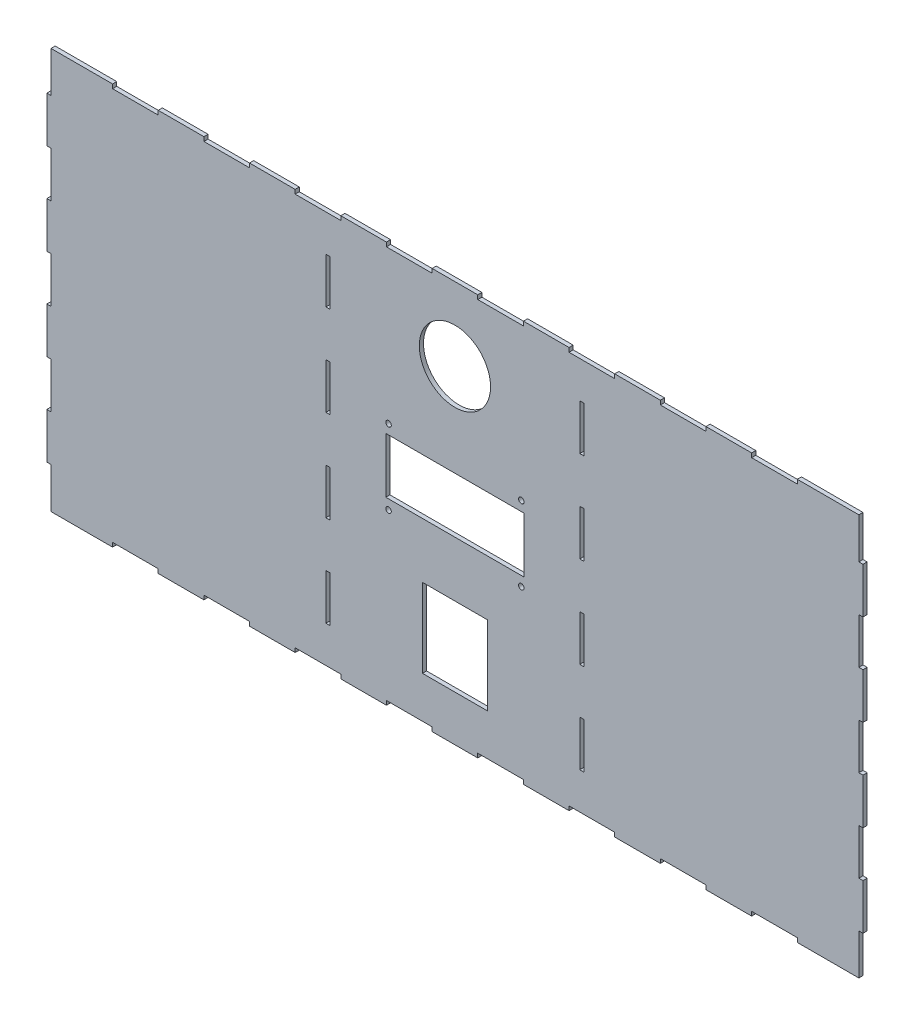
from build123d import *

# Parameters (mm, degrees)
SKETCH1_R           = 25.75
SKETCH1_R_2         = 2
SKETCH1_W           = 3
SKETCH1_H           = 33
SKETCH1_W_2         = 100
SKETCH1_H_2         = 40
SKETCH1_W_3         = 47
SKETCH1_H_3         = 57
BOSS_EXTRUDE1_DEPTH = 3


with BuildPart() as part:
    # Sketch1 → Boss-Extrude1 (new body)
    with BuildSketch(Plane.XY):
        Polygon((296, 586), (296, 556.5), (293, 556.5), (293, 523.5), (296, 523.5), (296, 490.5), (293, 490.5), (293, 457.5), (296, 457.5), (296, 424.5), (293, 424.5), (293, 391.5), (296, 391.5), (296, 358.5), (293, 358.5), (293, 325.5), (296, 325.5), (296, 296), (340.5, 296), (340.5, 299), (373.5, 299), (373.5, 296), (406.5, 296), (406.5, 299), (439.5, 299), (439.5, 296), (472.5, 296), (472.5, 299), (505.5, 299), (505.5, 296), (538.5, 296), (538.5, 299), (571.5, 299), (571.5, 296), (604.5, 296), (604.5, 299), (637.5, 299), (637.5, 296), (670.5, 296), (670.5, 299), (703.5, 299), (703.5, 296), (736.5, 296), (736.5, 299), (769.5, 299), (769.5, 296), (802.5, 296), (802.5, 299), (835.5, 299), (835.5, 296), (868.5, 296), (880, 296), (880, 325.5), (883, 325.5), (883, 358.5), (880, 358.5), (880, 391.5), (883, 391.5), (883, 424.5), (880, 424.5), (880, 457.5), (883, 457.5), (883, 490.5), (880, 490.5), (880, 523.5), (883, 523.5), (883, 556.5), (880, 556.5), (880, 586), (835.5, 586), (835.5, 583), (802.5, 583), (802.5, 586), (769.5, 586), (769.5, 583), (736.5, 583), (736.5, 586), (703.5, 586), (703.5, 583), (670.5, 583), (670.5, 586), (637.5, 586), (637.5, 583), (604.5, 583), (604.5, 586), (571.5, 586), (571.5, 583), (538.5, 583), (538.5, 586), (505.5, 586), (505.5, 583), (472.5, 583), (472.5, 586), (439.5, 586), (439.5, 583), (406.5, 583), (406.5, 586), (373.5, 586), (373.5, 583), (340.5, 583), (340.5, 586), (307.5, 586), align=None)
        with Locations((588, 533)):
            Circle(SKETCH1_R, mode=Mode.SUBTRACT)
        with Locations((636, 473)):
            Circle(SKETCH1_R_2, mode=Mode.SUBTRACT)
        with Locations((540, 473)):
            Circle(SKETCH1_R_2, mode=Mode.SUBTRACT)
        with Locations((540, 419)):
            Circle(SKETCH1_R_2, mode=Mode.SUBTRACT)
        with Locations((636, 419)):
            Circle(SKETCH1_R_2, mode=Mode.SUBTRACT)
        with Locations((496.25, 540)):
            Rectangle(SKETCH1_W, SKETCH1_H, mode=Mode.SUBTRACT)
        with Locations((588, 446)):
            Rectangle(SKETCH1_W_2, SKETCH1_H_2, mode=Mode.SUBTRACT)
        with Locations((679.75, 540)):
            Rectangle(SKETCH1_W, SKETCH1_H, mode=Mode.SUBTRACT)
        with Locations((679.75, 474)):
            Rectangle(SKETCH1_W, SKETCH1_H, mode=Mode.SUBTRACT)
        with Locations((679.75, 408)):
            Rectangle(SKETCH1_W, SKETCH1_H, mode=Mode.SUBTRACT)
        with Locations((679.75, 342)):
            Rectangle(SKETCH1_W, SKETCH1_H, mode=Mode.SUBTRACT)
        with Locations((496.25, 474)):
            Rectangle(SKETCH1_W, SKETCH1_H, mode=Mode.SUBTRACT)
        with Locations((496.25, 408)):
            Rectangle(SKETCH1_W, SKETCH1_H, mode=Mode.SUBTRACT)
        with Locations((496.25, 342)):
            Rectangle(SKETCH1_W, SKETCH1_H, mode=Mode.SUBTRACT)
        with Locations((588, 357.5)):
            Rectangle(SKETCH1_W_3, SKETCH1_H_3, mode=Mode.SUBTRACT)
    extrude(amount=BOSS_EXTRUDE1_DEPTH)


solid = part.part
